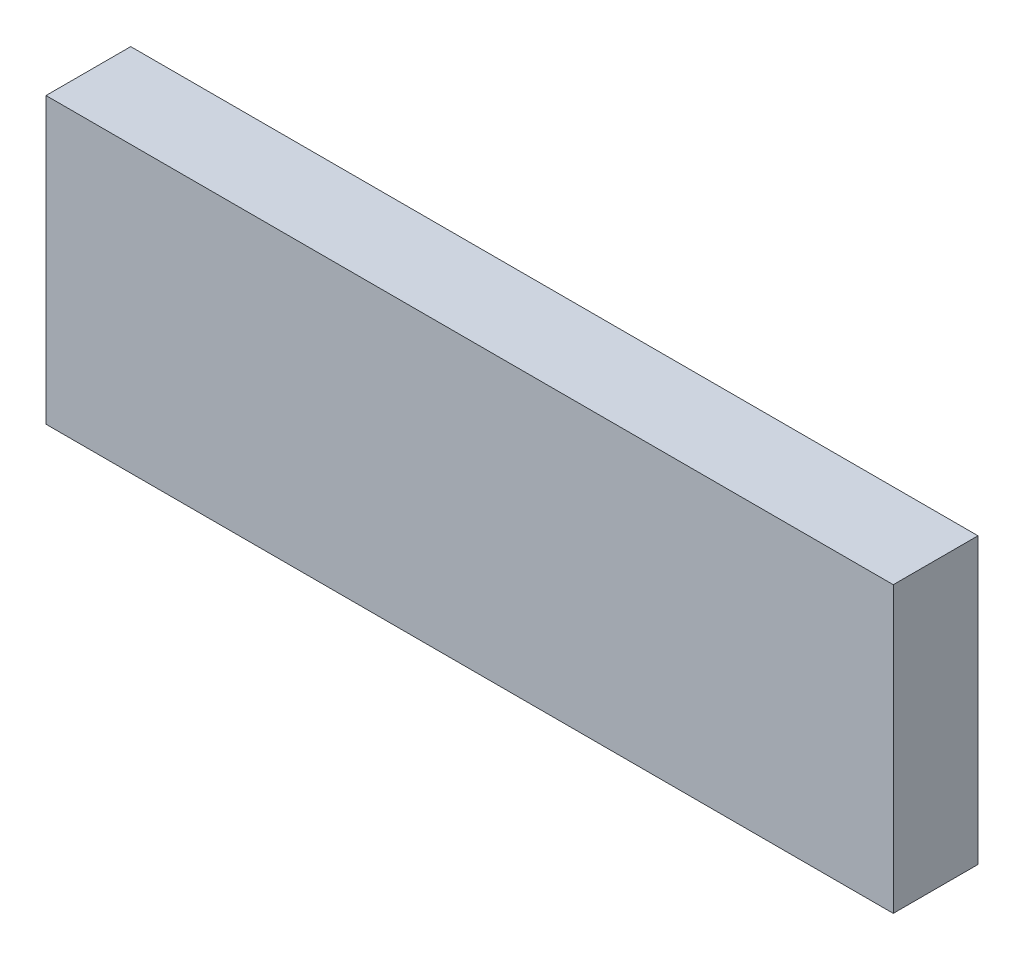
from build123d import *

# Parameters (mm, degrees)
SKETCH1_W      = 31.75
SKETCH1_H      = 10.668
EXTRUDE1_DEPTH = 3.175


with BuildPart() as part:
    # Sketch1 → Extrude1 (new body)
    with BuildSketch(Plane.XY):
        with Locations((15.875, 5.334)):
            Rectangle(SKETCH1_W, SKETCH1_H)
    extrude(amount=EXTRUDE1_DEPTH)


solid = part.part
